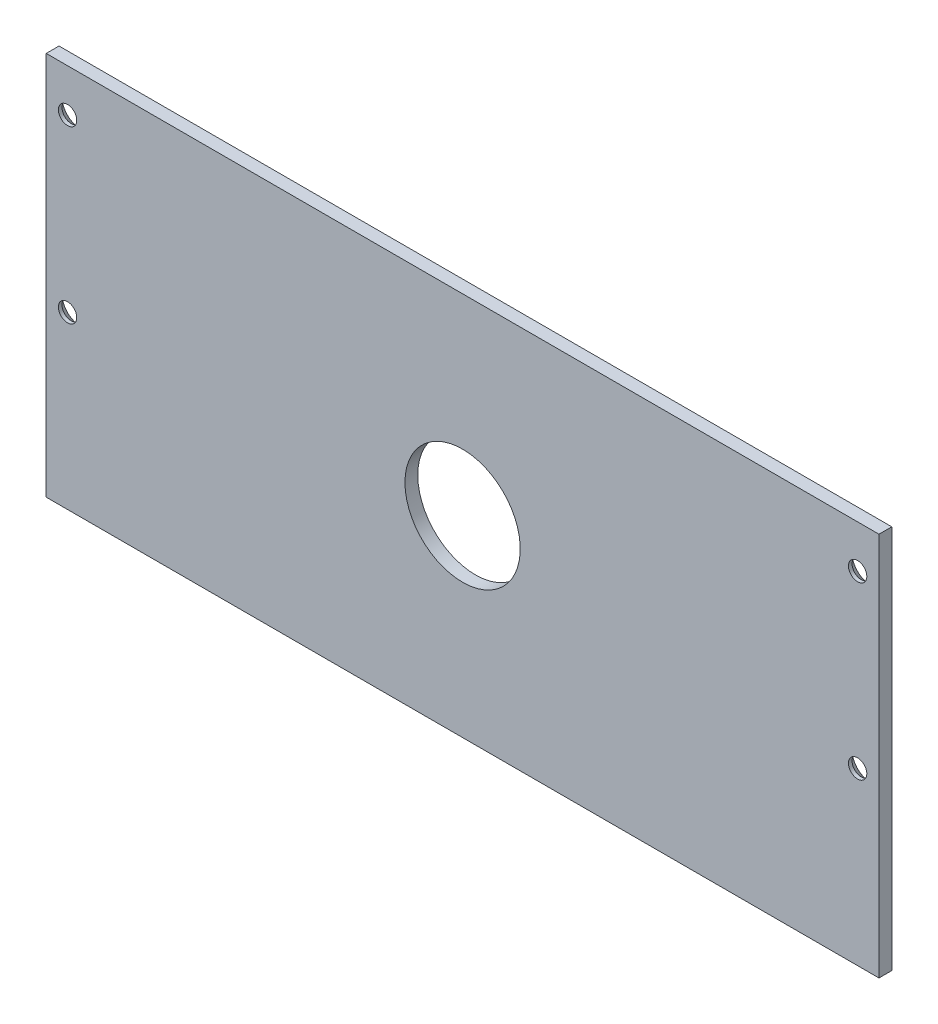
from build123d import *

# Parameters (mm, degrees)
SKETCH_1_W          = 195
SKETCH_1_H          = 90
EXTRUDE_1_DEPTH     = 3
SKETCH_2_R          = 4.3
CUT_EXTRUDE_1_DEPTH = 2.15
DRAFT_1_ANGLE       = 45
SKETCH_3_R          = 2.15
CUT_EXTRUDE_2_DEPTH = 215.778077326
SKETCH_4_R          = 2.15
CUT_EXTRUDE_3_DEPTH = 215.778077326
SKETCH_5_R          = 2.15
CUT_EXTRUDE_4_DEPTH = 215.778077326
SKETCH_6_R          = 2.15
CUT_EXTRUDE_5_DEPTH = 215.778077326
SKETCH_7_R          = 13.5
CUT_EXTRUDE_6_DEPTH = 215.788267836


with BuildPart() as part:
    # Sketch 1 → Extrude 1 (new body)
    with BuildSketch(Plane.XY):
        with Locations((97.5, 45)):
            Rectangle(SKETCH_1_W, SKETCH_1_H)
    extrude(amount=EXTRUDE_1_DEPTH)

    # Sketch 2 → Cut-Extrude 1 (cut)
    with BuildSketch(Plane(origin=(0, 0, 0), x_dir=(-1, 0, 0), z_dir=(0, 0, -1))):
        with Locations((-190, 80)):
            Circle(SKETCH_2_R)
        with Locations((-190, 40)):
            Circle(SKETCH_2_R)
        with Locations((-5, 80)):
            Circle(SKETCH_2_R)
        with Locations((-5, 40)):
            Circle(SKETCH_2_R)
    extrude(amount=-CUT_EXTRUDE_1_DEPTH, mode=Mode.SUBTRACT)

    # Draft 1
    draft_1_faces = [part.faces().sort_by_distance(p)[0] for p in [
        (9.3, 40, 1.075),
        (9.3, 80, 1.075),
        (194.3, 40, 1.075),
        (194.3, 80, 1.075),
    ]]
    draft(draft_1_faces, Plane(origin=(0, 0, 0), x_dir=(-1, 0, 0), z_dir=(0, 0, -1)), DRAFT_1_ANGLE)

    # Sketch 3 → Cut-Extrude 2 (cut, through all)
    with BuildSketch(Plane(origin=(0, 0, 2.15), x_dir=(-1, 0, 0), z_dir=(0, 0, -1))):
        with Locations((-190, 80)):
            Circle(SKETCH_3_R)
    extrude(amount=-CUT_EXTRUDE_2_DEPTH, mode=Mode.SUBTRACT)

    # Sketch 4 → Cut-Extrude 3 (cut, through all)
    with BuildSketch(Plane(origin=(0, 0, 2.15), x_dir=(-1, 0, 0), z_dir=(0, 0, -1))):
        with Locations((-190, 40)):
            Circle(SKETCH_4_R)
    extrude(amount=-CUT_EXTRUDE_3_DEPTH, mode=Mode.SUBTRACT)

    # Sketch 5 → Cut-Extrude 4 (cut, through all)
    with BuildSketch(Plane(origin=(0, 0, 2.15), x_dir=(-1, 0, 0), z_dir=(0, 0, -1))):
        with Locations((-5, 80)):
            Circle(SKETCH_5_R)
    extrude(amount=-CUT_EXTRUDE_4_DEPTH, mode=Mode.SUBTRACT)

    # Sketch 6 → Cut-Extrude 5 (cut, through all)
    with BuildSketch(Plane(origin=(0, 0, 2.15), x_dir=(-1, 0, 0), z_dir=(0, 0, -1))):
        with Locations((-5, 40)):
            Circle(SKETCH_6_R)
    extrude(amount=-CUT_EXTRUDE_5_DEPTH, mode=Mode.SUBTRACT)

    # Sketch 7 → Cut-Extrude 6 (cut, through all)
    with BuildSketch(Plane(origin=(0, 0, 0), x_dir=(-1, 0, 0), z_dir=(0, 0, -1))):
        with Locations((-97.5, 45)):
            Circle(SKETCH_7_R)
    extrude(amount=-CUT_EXTRUDE_6_DEPTH, mode=Mode.SUBTRACT)


solid = part.part
